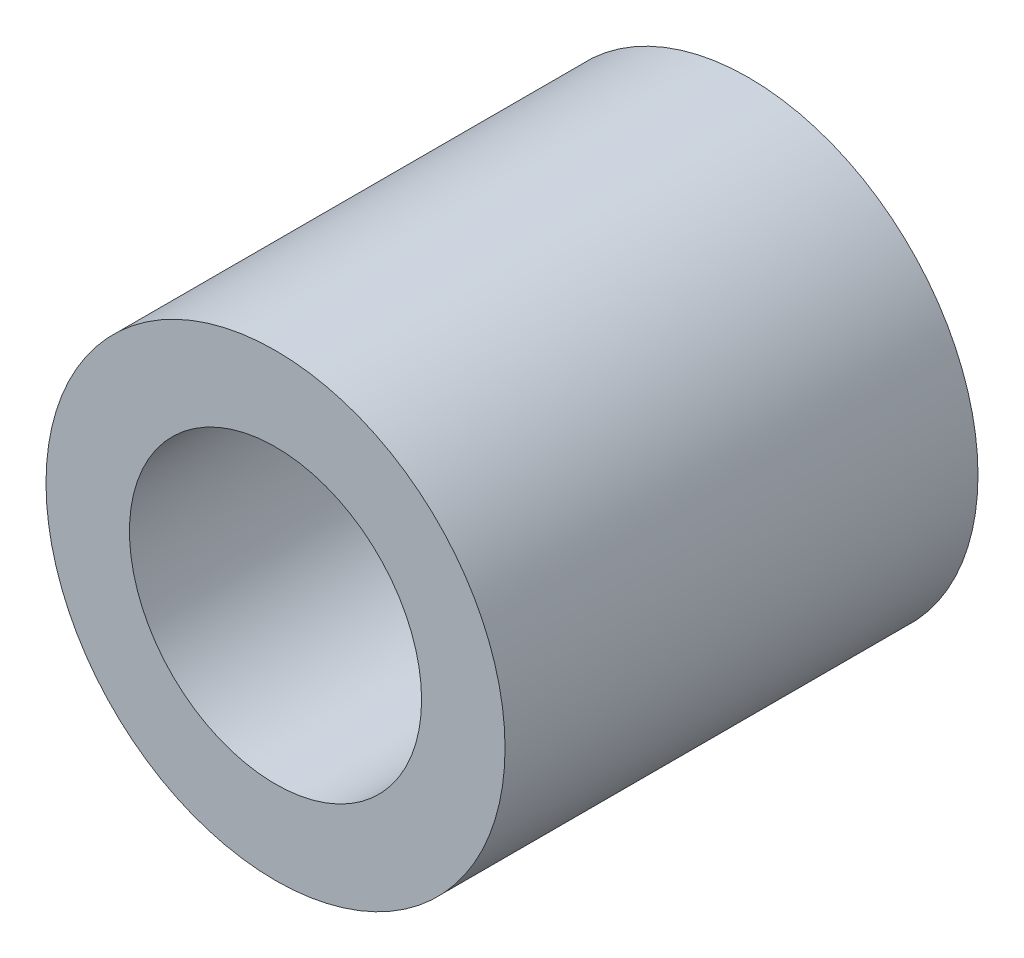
ISO-10303-21;
HEADER;
FILE_DESCRIPTION(('STEP AP214'),'2;1');
FILE_NAME('part.step','',(''),(''),'','','');
FILE_SCHEMA(('AUTOMOTIVE_DESIGN { 1 0 10303 214 1 1 1 1 }'));
ENDSEC;
DATA;
#1=APPLICATION_CONTEXT('core data for automotive mechanical design processes');
#2=APPLICATION_PROTOCOL_DEFINITION('international standard','automotive_design',2000,#1);
#3=PRODUCT_CONTEXT('',#1,'mechanical');
#4=PRODUCT('Part','Part','',(#3));
#5=PRODUCT_RELATED_PRODUCT_CATEGORY('part','',(#4));
#6=PRODUCT_DEFINITION_FORMATION('','',#4);
#7=PRODUCT_DEFINITION_CONTEXT('part definition',#1,'design');
#8=PRODUCT_DEFINITION('design','',#6,#7);
#9=PRODUCT_DEFINITION_SHAPE('','',#8);
#10=(LENGTH_UNIT() NAMED_UNIT(*) SI_UNIT(.MILLI.,.METRE.));
#11=(NAMED_UNIT(*) PLANE_ANGLE_UNIT() SI_UNIT($,.RADIAN.));
#12=(NAMED_UNIT(*) SI_UNIT($,.STERADIAN.) SOLID_ANGLE_UNIT());
#13=UNCERTAINTY_MEASURE_WITH_UNIT(LENGTH_MEASURE(1.E-05),#10,'distance_accuracy_value','');
#14=(GEOMETRIC_REPRESENTATION_CONTEXT(3) GLOBAL_UNCERTAINTY_ASSIGNED_CONTEXT((#13)) GLOBAL_UNIT_ASSIGNED_CONTEXT((#10,
#11,#12)) REPRESENTATION_CONTEXT('',''));
#15=CARTESIAN_POINT('',(0.,0.,0.));
#16=DIRECTION('',(0.,0.,1.));
#17=DIRECTION('',(1.,0.,0.));
#18=AXIS2_PLACEMENT_3D('',#15,#16,#17);
#19=CARTESIAN_POINT('',(0.,0.,17.));
#20=DIRECTION('',(0.,0.,1.));
#21=DIRECTION('',(1.,0.,0.));
#22=AXIS2_PLACEMENT_3D('',#19,#20,#21);
#23=PLANE('',#22);
#24=CARTESIAN_POINT('',(0.,0.,17.));
#25=DIRECTION('',(0.,0.,1.));
#26=DIRECTION('',(1.,0.,0.));
#27=AXIS2_PLACEMENT_3D('',#24,#25,#26);
#28=CIRCLE('',#27,8.25);
#29=CARTESIAN_POINT('',(8.25,0.,17.));
#30=VERTEX_POINT('',#29);
#31=EDGE_CURVE('E12',#30,#30,#28,.T.);
#32=ORIENTED_EDGE('',*,*,#31,.T.);
#33=EDGE_LOOP('',(#32));
#34=FACE_BOUND('',#33,.T.);
#35=CARTESIAN_POINT('',(0.,0.,17.));
#36=DIRECTION('',(0.,0.,1.));
#37=DIRECTION('',(1.,0.,0.));
#38=AXIS2_PLACEMENT_3D('',#35,#36,#37);
#39=CIRCLE('',#38,5.25);
#40=CARTESIAN_POINT('',(5.25,0.,17.));
#41=VERTEX_POINT('',#40);
#42=EDGE_CURVE('E51',#41,#41,#39,.T.);
#43=ORIENTED_EDGE('',*,*,#42,.F.);
#44=EDGE_LOOP('',(#43));
#45=FACE_BOUND('',#44,.T.);
#46=ADVANCED_FACE('F40',(#34,#45),#23,.T.);
#47=CARTESIAN_POINT('',(0.,0.,0.));
#48=DIRECTION('',(0.,0.,1.));
#49=DIRECTION('',(1.,0.,0.));
#50=AXIS2_PLACEMENT_3D('',#47,#48,#49);
#51=PLANE('',#50);
#52=CARTESIAN_POINT('',(0.,0.,0.));
#53=DIRECTION('',(0.,0.,1.));
#54=DIRECTION('',(1.,0.,0.));
#55=AXIS2_PLACEMENT_3D('',#52,#53,#54);
#56=CIRCLE('',#55,8.25);
#57=CARTESIAN_POINT('',(8.25,0.,0.));
#58=VERTEX_POINT('',#57);
#59=EDGE_CURVE('E44',#58,#58,#56,.T.);
#60=ORIENTED_EDGE('',*,*,#59,.F.);
#61=EDGE_LOOP('',(#60));
#62=FACE_BOUND('',#61,.T.);
#63=CARTESIAN_POINT('',(0.,0.,0.));
#64=DIRECTION('',(0.,0.,1.));
#65=DIRECTION('',(1.,0.,0.));
#66=AXIS2_PLACEMENT_3D('',#63,#64,#65);
#67=CIRCLE('',#66,5.25);
#68=CARTESIAN_POINT('',(5.25,0.,0.));
#69=VERTEX_POINT('',#68);
#70=EDGE_CURVE('E53',#69,#69,#67,.T.);
#71=ORIENTED_EDGE('',*,*,#70,.T.);
#72=EDGE_LOOP('',(#71));
#73=FACE_BOUND('',#72,.T.);
#74=ADVANCED_FACE('F63',(#62,#73),#51,.F.);
#75=CARTESIAN_POINT('',(0.,0.,17.));
#76=DIRECTION('',(0.,0.,-1.));
#77=DIRECTION('',(-1.,0.,0.));
#78=AXIS2_PLACEMENT_3D('',#75,#76,#77);
#79=CYLINDRICAL_SURFACE('',#78,8.25);
#80=ORIENTED_EDGE('',*,*,#31,.F.);
#81=EDGE_LOOP('',(#80));
#82=FACE_BOUND('',#81,.T.);
#83=ORIENTED_EDGE('',*,*,#59,.T.);
#84=EDGE_LOOP('',(#83));
#85=FACE_BOUND('',#84,.T.);
#86=ADVANCED_FACE('F42',(#82,#85),#79,.T.);
#87=CARTESIAN_POINT('',(0.,0.,17.));
#88=DIRECTION('',(0.,0.,-1.));
#89=DIRECTION('',(-1.,0.,0.));
#90=AXIS2_PLACEMENT_3D('',#87,#88,#89);
#91=CYLINDRICAL_SURFACE('',#90,5.25);
#92=ORIENTED_EDGE('',*,*,#42,.T.);
#93=EDGE_LOOP('',(#92));
#94=FACE_BOUND('',#93,.T.);
#95=ORIENTED_EDGE('',*,*,#70,.F.);
#96=EDGE_LOOP('',(#95));
#97=FACE_BOUND('',#96,.T.);
#98=ADVANCED_FACE('F59',(#94,#97),#91,.F.);
#99=CLOSED_SHELL('',(#46,#74,#86,#98));
#100=MANIFOLD_SOLID_BREP('B2',#99);
#101=ADVANCED_BREP_SHAPE_REPRESENTATION('',(#18,#100),#14);
#102=SHAPE_DEFINITION_REPRESENTATION(#9,#101);
ENDSEC;
END-ISO-10303-21;
